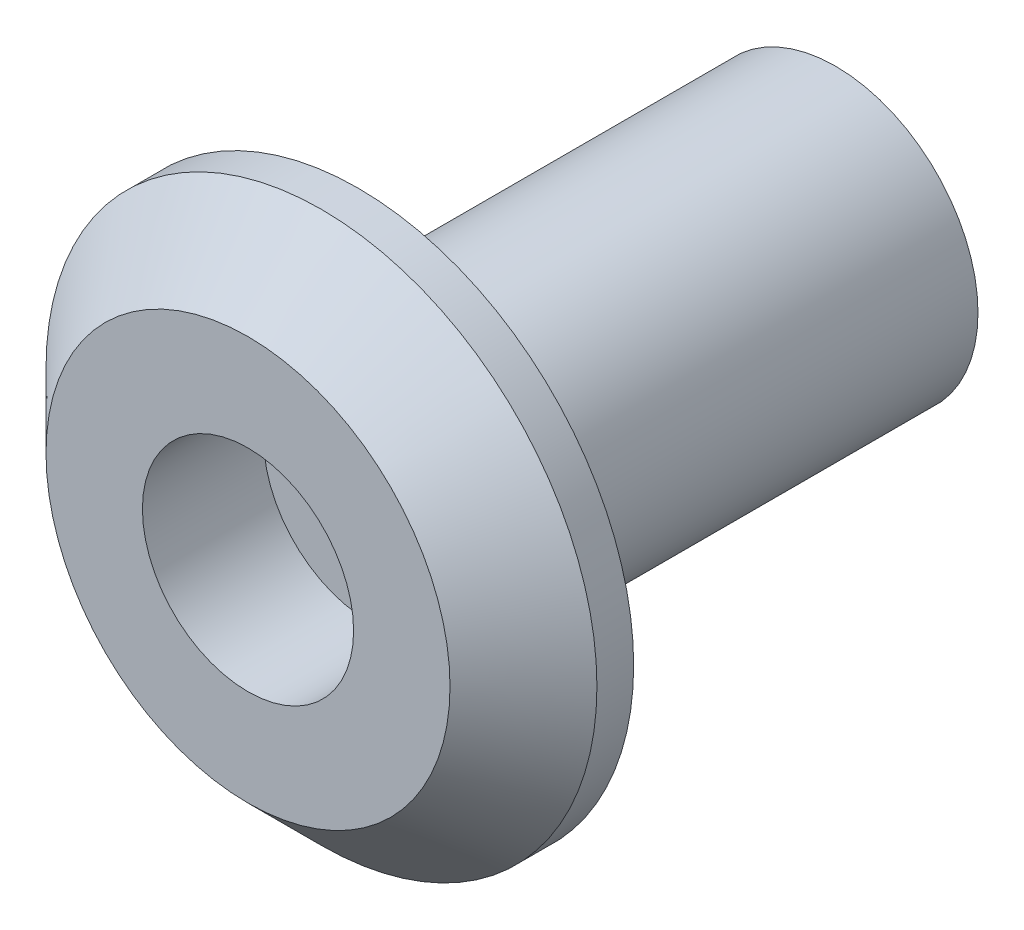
from build123d import *
from build123d.topology import SkipClean

# Parameters (mm, degrees)
CROQUIS1_R              = 7.5
CROQUIS1_R_2            = 1.55
SALIENTE_EXTRUIR1_DEPTH = 1.5
CHAFL_N1_SIZE           = 2
SALIENTE_EXTRUIR2_START = 13
CROQUIS2_R              = 3.875
CROQUIS2_R_2            = 1.55
SALIENTE_EXTRUIR2_DEPTH = 13
CROQUIS3_R              = 2.875
CORTAR_EXTRUIR1_DEPTH   = 3.3


with BuildPart() as part:
    # Croquis1 → Saliente-Extruir1 (new, symmetric)
    with BuildSketch(Plane.XY):
        Circle(CROQUIS1_R)
        Circle(CROQUIS1_R_2, mode=Mode.SUBTRACT)
    extrude(amount=SALIENTE_EXTRUIR1_DEPTH, both=True)

    # Chafl_n1
    chafl_n1_edges = [part.edges().sort_by_distance(p)[0] for p in [
        (-7.5, 0, 1.5),
    ]]
    chamfer(chafl_n1_edges, length=CHAFL_N1_SIZE)

    # Croquis2 → Saliente-Extruir2 (add)
    with SkipClean():  # the faces are left unmerged after this step: merging them gives an invalid solid
        with BuildSketch(Plane(origin=(0, 0, -1.5), x_dir=(-1, 0, 0), z_dir=(0, 0, -1)).offset(SALIENTE_EXTRUIR2_START)):
            with Locations(Location((0, 0, 0), (0, 0, 180))):
                Circle(CROQUIS2_R)
            Circle(CROQUIS2_R_2, mode=Mode.SUBTRACT)
        extrude(amount=-SALIENTE_EXTRUIR2_DEPTH)

    # Croquis3 → Cortar-Extruir1 (cut)
    with BuildSketch(Plane.XY.offset(1.5)):
        Circle(CROQUIS3_R)
    extrude(amount=-CORTAR_EXTRUIR1_DEPTH, mode=Mode.SUBTRACT)


solid = part.part
